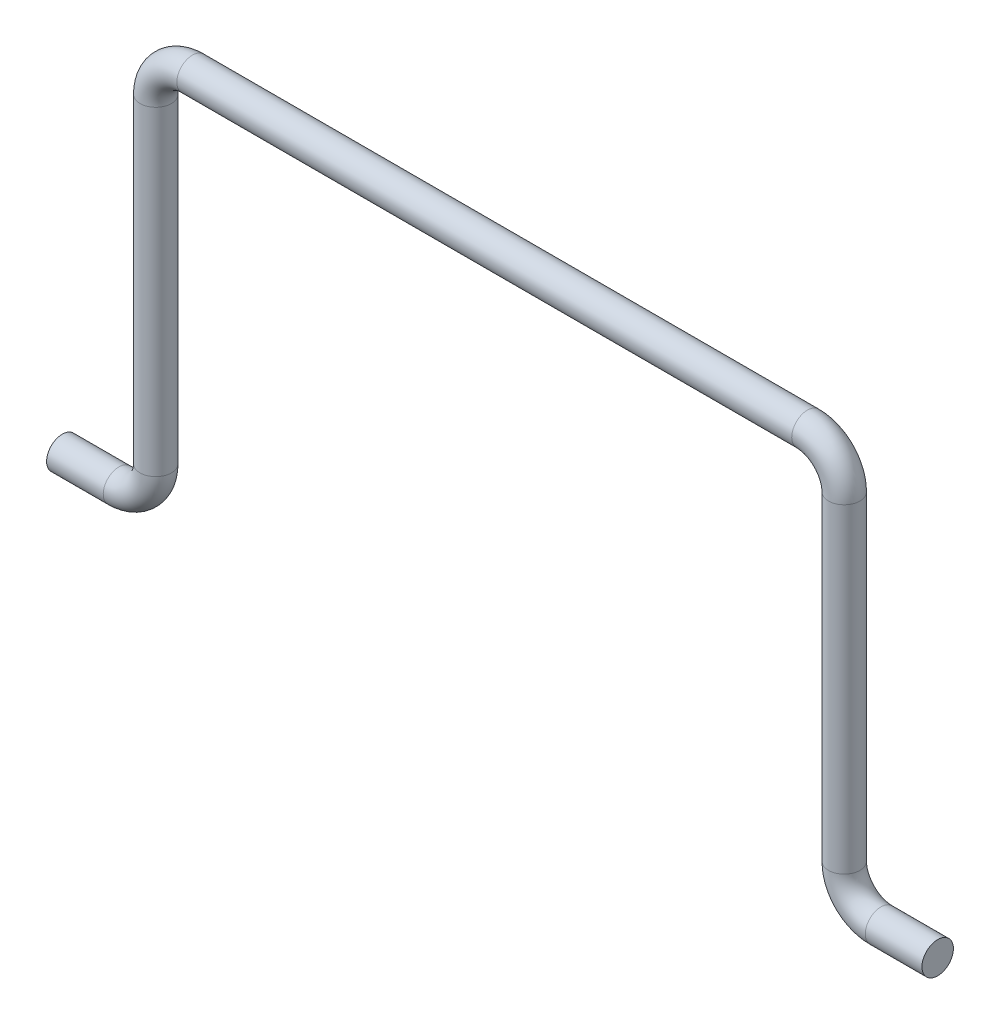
ISO-10303-21;
HEADER;
FILE_DESCRIPTION(('STEP AP214'),'2;1');
FILE_NAME('part.step','',(''),(''),'','','');
FILE_SCHEMA(('AUTOMOTIVE_DESIGN { 1 0 10303 214 1 1 1 1 }'));
ENDSEC;
DATA;
#1=APPLICATION_CONTEXT('core data for automotive mechanical design processes');
#2=APPLICATION_PROTOCOL_DEFINITION('international standard','automotive_design',2000,#1);
#3=PRODUCT_CONTEXT('',#1,'mechanical');
#4=PRODUCT('Part','Part','',(#3));
#5=PRODUCT_RELATED_PRODUCT_CATEGORY('part','',(#4));
#6=PRODUCT_DEFINITION_FORMATION('','',#4);
#7=PRODUCT_DEFINITION_CONTEXT('part definition',#1,'design');
#8=PRODUCT_DEFINITION('design','',#6,#7);
#9=PRODUCT_DEFINITION_SHAPE('','',#8);
#10=(LENGTH_UNIT() NAMED_UNIT(*) SI_UNIT(.MILLI.,.METRE.));
#11=(NAMED_UNIT(*) PLANE_ANGLE_UNIT() SI_UNIT($,.RADIAN.));
#12=(NAMED_UNIT(*) SI_UNIT($,.STERADIAN.) SOLID_ANGLE_UNIT());
#13=UNCERTAINTY_MEASURE_WITH_UNIT(LENGTH_MEASURE(1.E-05),#10,'distance_accuracy_value','');
#14=(GEOMETRIC_REPRESENTATION_CONTEXT(3) GLOBAL_UNCERTAINTY_ASSIGNED_CONTEXT((#13)) GLOBAL_UNIT_ASSIGNED_CONTEXT((#10,
#11,#12)) REPRESENTATION_CONTEXT('',''));
#15=CARTESIAN_POINT('',(0.,0.,0.));
#16=DIRECTION('',(0.,0.,1.));
#17=DIRECTION('',(1.,0.,0.));
#18=AXIS2_PLACEMENT_3D('',#15,#16,#17);
#19=CARTESIAN_POINT('',(-49.1998,0.,0.));
#20=DIRECTION('',(-1.,0.,0.));
#21=DIRECTION('',(0.,0.,1.));
#22=AXIS2_PLACEMENT_3D('',#19,#20,#21);
#23=CYLINDRICAL_SURFACE('',#22,2.032);
#24=CARTESIAN_POINT('',(-49.1998,0.,0.));
#25=DIRECTION('',(1.,0.,0.));
#26=DIRECTION('',(0.,0.,-1.));
#27=AXIS2_PLACEMENT_3D('',#24,#25,#26);
#28=CIRCLE('',#27,2.032);
#29=CARTESIAN_POINT('',(-49.1998,-2.03200000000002,0.));
#30=VERTEX_POINT('',#29);
#31=EDGE_CURVE('E32',#30,#30,#28,.T.);
#32=ORIENTED_EDGE('',*,*,#31,.F.);
#33=EDGE_LOOP('',(#32));
#34=FACE_BOUND('',#33,.T.);
#35=CARTESIAN_POINT('',(-56.515,0.,0.));
#36=DIRECTION('',(1.,0.,0.));
#37=DIRECTION('',(0.,0.,-1.));
#38=AXIS2_PLACEMENT_3D('',#35,#36,#37);
#39=CIRCLE('',#38,2.032);
#40=CARTESIAN_POINT('',(-56.515,0.,-2.032));
#41=VERTEX_POINT('',#40);
#42=EDGE_CURVE('E10',#41,#41,#39,.T.);
#43=ORIENTED_EDGE('',*,*,#42,.T.);
#44=EDGE_LOOP('',(#43));
#45=FACE_BOUND('',#44,.T.);
#46=ADVANCED_FACE('F26',(#34,#45),#23,.T.);
#47=CARTESIAN_POINT('',(-49.1998,4.7498,0.));
#48=DIRECTION('',(0.,0.,-1.));
#49=DIRECTION('',(-1.,0.,0.));
#50=AXIS2_PLACEMENT_3D('',#47,#48,#49);
#51=TOROIDAL_SURFACE('',#50,4.74980000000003,2.032);
#52=CARTESIAN_POINT('',(-44.45,4.74979999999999,0.));
#53=DIRECTION('',(0.,1.,0.));
#54=DIRECTION('',(0.,0.,-1.));
#55=AXIS2_PLACEMENT_3D('',#52,#53,#54);
#56=CIRCLE('',#55,2.032);
#57=CARTESIAN_POINT('',(-42.418,4.74979999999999,0.));
#58=VERTEX_POINT('',#57);
#59=EDGE_CURVE('E36',#58,#58,#56,.T.);
#60=CARTESIAN_POINT('',(-49.1998,4.7498,0.));
#61=DIRECTION('',(0.,0.,-1.));
#62=DIRECTION('',(-1.,0.,0.));
#63=AXIS2_PLACEMENT_3D('',#60,#61,#62);
#64=CIRCLE('',#63,6.78180000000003);
#65=EDGE_CURVE('',#58,#30,#64,.T.);
#66=ORIENTED_EDGE('',*,*,#59,.F.);
#67=ORIENTED_EDGE('',*,*,#31,.T.);
#68=ORIENTED_EDGE('',*,*,#65,.T.);
#69=ORIENTED_EDGE('',*,*,#65,.F.);
#70=EDGE_LOOP('',(#66,#68,#67,#69));
#71=FACE_BOUND('',#70,.T.);
#72=ADVANCED_FACE('F82',(#71),#51,.T.);
#73=CARTESIAN_POINT('',(-44.45,46.0502,0.));
#74=DIRECTION('',(0.,-1.,0.));
#75=DIRECTION('',(0.,0.,-1.));
#76=AXIS2_PLACEMENT_3D('',#73,#74,#75);
#77=CYLINDRICAL_SURFACE('',#76,2.032);
#78=CARTESIAN_POINT('',(-44.45,46.0502,0.));
#79=DIRECTION('',(0.,1.,0.));
#80=DIRECTION('',(0.,0.,-1.));
#81=AXIS2_PLACEMENT_3D('',#78,#79,#80);
#82=CIRCLE('',#81,2.032);
#83=CARTESIAN_POINT('',(-46.482,46.0502,0.));
#84=VERTEX_POINT('',#83);
#85=EDGE_CURVE('E40',#84,#84,#82,.T.);
#86=ORIENTED_EDGE('',*,*,#85,.F.);
#87=EDGE_LOOP('',(#86));
#88=FACE_BOUND('',#87,.T.);
#89=ORIENTED_EDGE('',*,*,#59,.T.);
#90=EDGE_LOOP('',(#89));
#91=FACE_BOUND('',#90,.T.);
#92=ADVANCED_FACE('F87',(#88,#91),#77,.T.);
#93=CARTESIAN_POINT('',(-39.7002,46.0502,0.));
#94=DIRECTION('',(0.,0.,1.));
#95=DIRECTION('',(1.,0.,0.));
#96=AXIS2_PLACEMENT_3D('',#93,#94,#95);
#97=TOROIDAL_SURFACE('',#96,4.74979999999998,2.032);
#98=CARTESIAN_POINT('',(-39.7002,50.8,0.));
#99=DIRECTION('',(1.,0.,0.));
#100=DIRECTION('',(0.,0.,-1.));
#101=AXIS2_PLACEMENT_3D('',#98,#99,#100);
#102=CIRCLE('',#101,2.032);
#103=CARTESIAN_POINT('',(-39.7002,52.832,0.));
#104=VERTEX_POINT('',#103);
#105=EDGE_CURVE('E45',#104,#104,#102,.T.);
#106=CARTESIAN_POINT('',(-39.7002,46.0502,0.));
#107=DIRECTION('',(0.,0.,1.));
#108=DIRECTION('',(1.,0.,0.));
#109=AXIS2_PLACEMENT_3D('',#106,#107,#108);
#110=CIRCLE('',#109,6.78179999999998);
#111=EDGE_CURVE('',#104,#84,#110,.T.);
#112=ORIENTED_EDGE('',*,*,#105,.F.);
#113=ORIENTED_EDGE('',*,*,#85,.T.);
#114=ORIENTED_EDGE('',*,*,#111,.T.);
#115=ORIENTED_EDGE('',*,*,#111,.F.);
#116=EDGE_LOOP('',(#112,#114,#113,#115));
#117=FACE_BOUND('',#116,.T.);
#118=ADVANCED_FACE('F92',(#117),#97,.T.);
#119=CARTESIAN_POINT('',(39.7002,50.8,0.));
#120=DIRECTION('',(-1.,0.,0.));
#121=DIRECTION('',(0.,-1.,0.));
#122=AXIS2_PLACEMENT_3D('',#119,#120,#121);
#123=CYLINDRICAL_SURFACE('',#122,2.032);
#124=CARTESIAN_POINT('',(39.7002,50.8,0.));
#125=DIRECTION('',(1.,0.,0.));
#126=DIRECTION('',(0.,0.,-1.));
#127=AXIS2_PLACEMENT_3D('',#124,#125,#126);
#128=CIRCLE('',#127,2.032);
#129=CARTESIAN_POINT('',(39.7002,52.832,0.));
#130=VERTEX_POINT('',#129);
#131=EDGE_CURVE('E48',#130,#130,#128,.T.);
#132=ORIENTED_EDGE('',*,*,#131,.F.);
#133=EDGE_LOOP('',(#132));
#134=FACE_BOUND('',#133,.T.);
#135=ORIENTED_EDGE('',*,*,#105,.T.);
#136=EDGE_LOOP('',(#135));
#137=FACE_BOUND('',#136,.T.);
#138=ADVANCED_FACE('F99',(#134,#137),#123,.T.);
#139=CARTESIAN_POINT('',(39.7002,46.0502,0.));
#140=DIRECTION('',(0.,0.,1.));
#141=DIRECTION('',(1.,0.,0.));
#142=AXIS2_PLACEMENT_3D('',#139,#140,#141);
#143=TOROIDAL_SURFACE('',#142,4.74979999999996,2.032);
#144=CARTESIAN_POINT('',(44.4499999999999,46.0502,0.));
#145=DIRECTION('',(0.,-1.,0.));
#146=DIRECTION('',(0.,0.,-1.));
#147=AXIS2_PLACEMENT_3D('',#144,#145,#146);
#148=CIRCLE('',#147,2.032);
#149=CARTESIAN_POINT('',(46.4819999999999,46.0502,0.));
#150=VERTEX_POINT('',#149);
#151=EDGE_CURVE('E51',#150,#150,#148,.T.);
#152=CARTESIAN_POINT('',(39.7002,46.0502,0.));
#153=DIRECTION('',(0.,0.,1.));
#154=DIRECTION('',(1.,0.,0.));
#155=AXIS2_PLACEMENT_3D('',#152,#153,#154);
#156=CIRCLE('',#155,6.78179999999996);
#157=EDGE_CURVE('',#150,#130,#156,.T.);
#158=ORIENTED_EDGE('',*,*,#151,.F.);
#159=ORIENTED_EDGE('',*,*,#131,.T.);
#160=ORIENTED_EDGE('',*,*,#157,.T.);
#161=ORIENTED_EDGE('',*,*,#157,.F.);
#162=EDGE_LOOP('',(#158,#160,#159,#161));
#163=FACE_BOUND('',#162,.T.);
#164=ADVANCED_FACE('F103',(#163),#143,.T.);
#165=CARTESIAN_POINT('',(44.45,4.74980000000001,0.));
#166=DIRECTION('',(0.,1.,0.));
#167=DIRECTION('',(-1.,0.,0.));
#168=AXIS2_PLACEMENT_3D('',#165,#166,#167);
#169=CYLINDRICAL_SURFACE('',#168,2.032);
#170=CARTESIAN_POINT('',(44.45,4.74980000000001,0.));
#171=DIRECTION('',(0.,-1.,0.));
#172=DIRECTION('',(0.,0.,-1.));
#173=AXIS2_PLACEMENT_3D('',#170,#171,#172);
#174=CIRCLE('',#173,2.032);
#175=CARTESIAN_POINT('',(42.418,4.74980000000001,0.));
#176=VERTEX_POINT('',#175);
#177=EDGE_CURVE('E54',#176,#176,#174,.T.);
#178=ORIENTED_EDGE('',*,*,#177,.F.);
#179=EDGE_LOOP('',(#178));
#180=FACE_BOUND('',#179,.T.);
#181=ORIENTED_EDGE('',*,*,#151,.T.);
#182=EDGE_LOOP('',(#181));
#183=FACE_BOUND('',#182,.T.);
#184=ADVANCED_FACE('F78',(#180,#183),#169,.T.);
#185=CARTESIAN_POINT('',(49.1998,4.74980000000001,0.));
#186=DIRECTION('',(0.,0.,-1.));
#187=DIRECTION('',(-1.,0.,0.));
#188=AXIS2_PLACEMENT_3D('',#185,#186,#187);
#189=TOROIDAL_SURFACE('',#188,4.74980000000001,2.032);
#190=CARTESIAN_POINT('',(49.1998,0.,0.));
#191=DIRECTION('',(1.,0.,0.));
#192=DIRECTION('',(0.,0.,-1.));
#193=AXIS2_PLACEMENT_3D('',#190,#191,#192);
#194=CIRCLE('',#193,2.032);
#195=CARTESIAN_POINT('',(49.1998,-2.032,0.));
#196=VERTEX_POINT('',#195);
#197=EDGE_CURVE('E57',#196,#196,#194,.T.);
#198=CARTESIAN_POINT('',(49.1998,4.74980000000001,0.));
#199=DIRECTION('',(0.,0.,-1.));
#200=DIRECTION('',(-1.,0.,0.));
#201=AXIS2_PLACEMENT_3D('',#198,#199,#200);
#202=CIRCLE('',#201,6.78180000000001);
#203=EDGE_CURVE('',#196,#176,#202,.T.);
#204=ORIENTED_EDGE('',*,*,#197,.F.);
#205=ORIENTED_EDGE('',*,*,#177,.T.);
#206=ORIENTED_EDGE('',*,*,#203,.T.);
#207=ORIENTED_EDGE('',*,*,#203,.F.);
#208=EDGE_LOOP('',(#204,#206,#205,#207));
#209=FACE_BOUND('',#208,.T.);
#210=ADVANCED_FACE('F69',(#209),#189,.T.);
#211=CARTESIAN_POINT('',(49.1998,0.,0.));
#212=DIRECTION('',(1.,0.,0.));
#213=DIRECTION('',(0.,1.,0.));
#214=AXIS2_PLACEMENT_3D('',#211,#212,#213);
#215=CYLINDRICAL_SURFACE('',#214,2.032);
#216=ORIENTED_EDGE('',*,*,#197,.T.);
#217=EDGE_LOOP('',(#216));
#218=FACE_BOUND('',#217,.T.);
#219=CARTESIAN_POINT('',(56.515,0.,0.));
#220=DIRECTION('',(1.,0.,0.));
#221=DIRECTION('',(0.,0.,-1.));
#222=AXIS2_PLACEMENT_3D('',#219,#220,#221);
#223=CIRCLE('',#222,2.032);
#224=CARTESIAN_POINT('',(56.515,0.,-2.032));
#225=VERTEX_POINT('',#224);
#226=EDGE_CURVE('E60',#225,#225,#223,.T.);
#227=ORIENTED_EDGE('',*,*,#226,.F.);
#228=EDGE_LOOP('',(#227));
#229=FACE_BOUND('',#228,.T.);
#230=ADVANCED_FACE('F66',(#218,#229),#215,.T.);
#231=CARTESIAN_POINT('',(-56.515,0.,0.));
#232=DIRECTION('',(1.,0.,0.));
#233=DIRECTION('',(0.,0.,-1.));
#234=AXIS2_PLACEMENT_3D('',#231,#232,#233);
#235=PLANE('',#234);
#236=ORIENTED_EDGE('',*,*,#42,.F.);
#237=EDGE_LOOP('',(#236));
#238=FACE_BOUND('',#237,.T.);
#239=ADVANCED_FACE('F68',(#238),#235,.F.);
#240=CARTESIAN_POINT('',(56.515,0.,0.));
#241=DIRECTION('',(1.,0.,0.));
#242=DIRECTION('',(0.,0.,-1.));
#243=AXIS2_PLACEMENT_3D('',#240,#241,#242);
#244=PLANE('',#243);
#245=ORIENTED_EDGE('',*,*,#226,.T.);
#246=EDGE_LOOP('',(#245));
#247=FACE_BOUND('',#246,.T.);
#248=ADVANCED_FACE('F64',(#247),#244,.T.);
#249=CLOSED_SHELL('',(#46,#72,#92,#118,#138,#164,#184,#210,#230,#239,#248));
#250=MANIFOLD_SOLID_BREP('B2',#249);
#251=ADVANCED_BREP_SHAPE_REPRESENTATION('',(#18,#250),#14);
#252=SHAPE_DEFINITION_REPRESENTATION(#9,#251);
ENDSEC;
END-ISO-10303-21;
